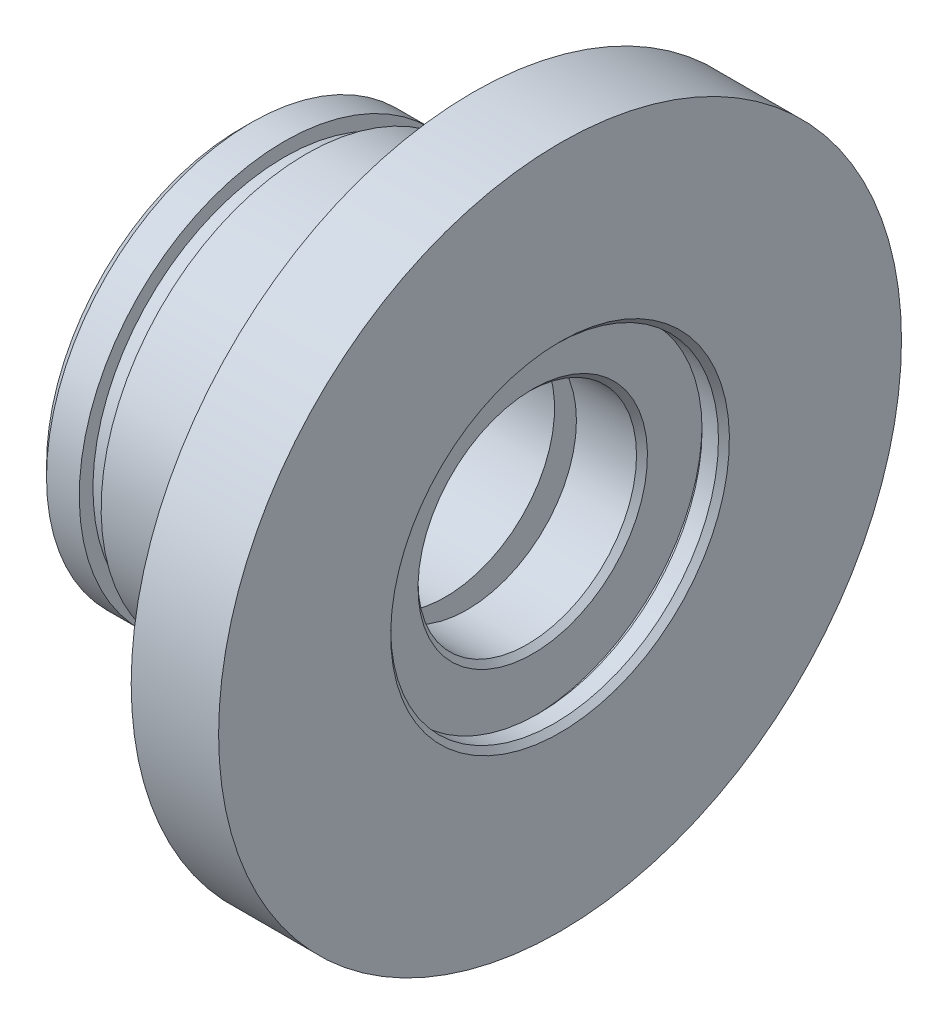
from build123d import *

# Parameters (mm, degrees)
ZAOKR_GLENIE1_R            = 10
SFAZOWANIE1_SIZE           = 4
SFAZOWANIE2_SIZE           = 4
SFAZOWANIE3_SIZE           = 2
SFAZOWANIE4_SIZE           = 2
WYTNIJ_WYCI_GNI_CIE1_REACH = 201.284
SZKIC2_W                   = 16
SZKIC2_H                   = 24.32737167


with BuildPart() as part:
    # Szkic1 → Obr_t1 (revolve)
    with BuildSketch(Plane.XY):
        Polygon((-75.184993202, 75), (-75.184993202, 55), (-50.184993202, 55), (-50.184993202, 40), (-0.184993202, 40), (-0.184993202, 54), (7.815006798, 54), (7.815006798, 40), (31.815006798, 40), (31.815006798, 62), (33.815006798, 62), (33.815006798, 60), (41.815006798, 60), (41.815006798, 125), (9.815006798, 125), (9.815006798, 75), (-51.184993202, 75), (-51.184993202, 70), (-59.184993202, 70), (-59.184993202, 75), align=None)
    revolve(axis=Axis((0, 0, 0), (-1, 0, 0)))

    # Zaokr_glenie1
    zaokr_glenie1_edges = [part.edges().sort_by_distance(p)[0] for p in [
        (9.815006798, -75, 0),
    ]]
    fillet(zaokr_glenie1_edges, radius=ZAOKR_GLENIE1_R)

    # Sfazowanie1
    sfazowanie1_edges = [part.edges().sort_by_distance(p)[0] for p in [
        (-75.184993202, -75, 0),
    ]]
    chamfer(sfazowanie1_edges, length=SFAZOWANIE1_SIZE)

    # Sfazowanie2
    sfazowanie2_edges = [part.edges().sort_by_distance(p)[0] for p in [
        (-75.184993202, -55, 0),
    ]]
    chamfer(sfazowanie2_edges, length=SFAZOWANIE2_SIZE)

    # Sfazowanie3
    sfazowanie3_edges = [part.edges().sort_by_distance(p)[0] for p in [
        (31.815006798, -40, 0),
    ]]
    chamfer(sfazowanie3_edges, length=SFAZOWANIE3_SIZE)

    # Sfazowanie4
    sfazowanie4_edges = [part.edges().sort_by_distance(p)[0] for p in [
        (41.815006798, -60, 0),
    ]]
    chamfer(sfazowanie4_edges, length=SFAZOWANIE4_SIZE)

    # Szkic2 → Wytnij-wyci_gni_cie1 (cut, up to next)
    with BuildSketch(Plane.ZY.offset(50.184993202), mode=Mode.PRIVATE) as wytnij_wyci_gni_cie1_sk1:
        with Locations((0, 39.836314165)):
            Rectangle(SZKIC2_W, SZKIC2_H)
    wytnij_wyci_gni_cie1_tool1 = extrude(wytnij_wyci_gni_cie1_sk1.sketch, amount=-WYTNIJ_WYCI_GNI_CIE1_REACH, mode=Mode.PRIVATE) & part.part
    add(wytnij_wyci_gni_cie1_tool1.solids().sort_by_distance((-50.184993, 39.836314, 0))[0], mode=Mode.SUBTRACT)


solid = part.part
